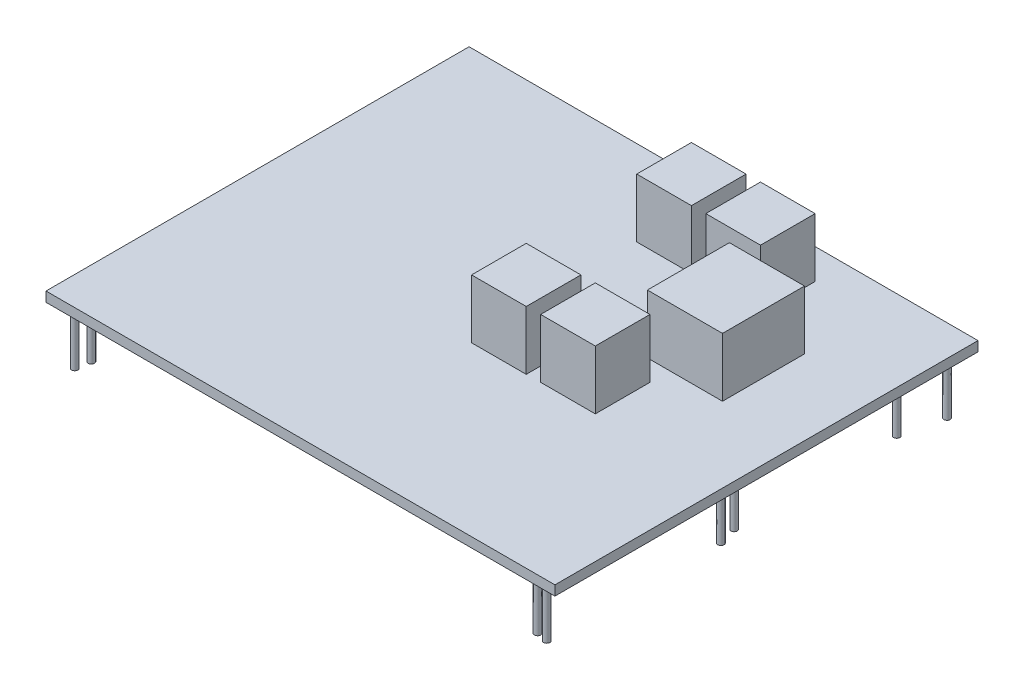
from build123d import *

# Parameters (mm, degrees)
SKETCH2_W           = 259.71
SKETCH2_H           = 215.9
BOSS_EXTRUDE1_DEPTH = 5
SKETCH1_R           = 1.6
BOSS_EXTRUDE2_DEPTH = 30
FANS_W              = 27.900833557
FANS_H              = 27.900833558
FANS_W_2            = 38.326934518
FANS_H_2            = 41.851250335
FANS_H_3            = 27.900833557
BOSS_EXTRUDE3_DEPTH = 30


with BuildPart() as part:
    # Sketch2 → Boss-Extrude1 (new body)
    with BuildSketch(Plane(origin=(0, 0, 0), x_dir=(1, 0, 0), z_dir=(0, 1, 0))):
        with Locations((-196.717193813, 0.240534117)):
            Rectangle(SKETCH2_W, SKETCH2_H)
    extrude(amount=BOSS_EXTRUDE1_DEPTH)

    # Sketch1 → Boss-Extrude2 (add)
    with BuildSketch(Plane(origin=(0, 0, 0), x_dir=(1, 0, 0), z_dir=(0, 1, 0))):
        with Locations(Location((-320.092193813, 101.170534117, 0), (0, 0, 270))):
            Circle(SKETCH1_R)
        with Locations(Location((-312.852193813, 99.850534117, 0), (0, 0, 270))):
            Circle(SKETCH1_R)
        with Locations(Location((-318.832193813, -92.309465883, 0), (0, 0, 270))):
            Circle(SKETCH1_R)
        with Locations(Location((-320.102193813, -99.489465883, 0), (0, 0, 270))):
            Circle(SKETCH1_R)
        with Locations(Location((-177.862193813, -34.399465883, 0), (0, 0, 270))):
            Circle(SKETCH1_R)
        with Locations(Location((-170.242193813, -34.399465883, 0), (0, 0, 270))):
            Circle(SKETCH1_R)
        with Locations(Location((-104.382193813, -25.149465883, 0), (0, 0, 270))):
            Circle(SKETCH1_R)
        with Locations(Location((-216.142193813, -6.769465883, 0), (0, 0, 270))):
            Circle(SKETCH1_R)
        with Locations(Location((-77.992193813, -11.859465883, 0), (0, 0, 270))):
            Circle(SKETCH1_R)
        with Locations(Location((-80.702193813, -2.389465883, 0), (0, 0, 270))):
            Circle(SKETCH1_R)
        with Locations(Location((-84.902193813, -98.529465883, 0), (0, 0, 270))):
            Circle(SKETCH1_R)
        with Locations(Location((-79.259756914, -99.489465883, 0), (0, 0, 270))):
            Circle(SKETCH1_R)
        with Locations(Location((-104.372193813, 71.880534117, 0), (0, 0, 270))):
            Circle(SKETCH1_R)
        with Locations(Location((-80.542193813, 80.410534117, 0), (0, 0, 270))):
            Circle(SKETCH1_R)
        with Locations(Location((-75.622193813, 101.170534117, 0), (0, 0, 270))):
            Circle(SKETCH1_R)
        with Locations(Location((-224.842193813, 89.780534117, 0), (0, 0, 270))):
            Circle(SKETCH1_R)
    extrude(amount=-BOSS_EXTRUDE2_DEPTH)

    # fans → Boss-Extrude3 (add)
    with BuildSketch(Plane(origin=(0, 5, 0), x_dir=(1, 0, 0), z_dir=(0, 1, 0))):
        with Locations((-146.055153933, -7.909446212)):
            Rectangle(FANS_W, FANS_H)
        with Locations((-124.395296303, 37.09900371)):
            Rectangle(FANS_W_2, FANS_H_2)
        with Locations((-181.151465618, -8.056292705)):
            Rectangle(FANS_W, FANS_H_3)
        with Locations((-148.478121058, 78.803407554)):
            Rectangle(FANS_W, FANS_H_3)
        with Locations((-183.574432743, 78.656561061)):
            Rectangle(FANS_W, FANS_H_3)
    extrude(amount=BOSS_EXTRUDE3_DEPTH)


solid = part.part
